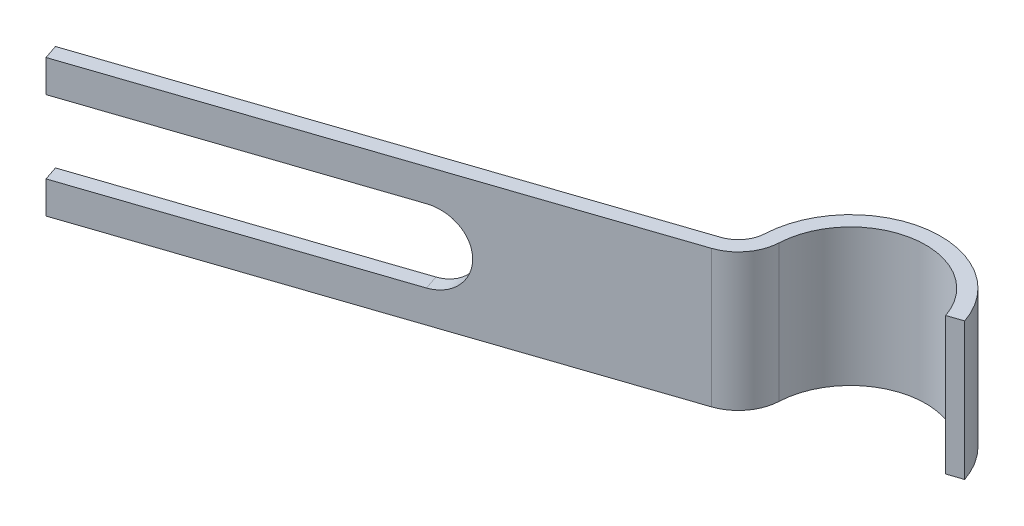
ISO-10303-21;
HEADER;
FILE_DESCRIPTION(('STEP AP214'),'2;1');
FILE_NAME('part.step','',(''),(''),'','','');
FILE_SCHEMA(('AUTOMOTIVE_DESIGN { 1 0 10303 214 1 1 1 1 }'));
ENDSEC;
DATA;
#1=APPLICATION_CONTEXT('core data for automotive mechanical design processes');
#2=APPLICATION_PROTOCOL_DEFINITION('international standard','automotive_design',2000,#1);
#3=PRODUCT_CONTEXT('',#1,'mechanical');
#4=PRODUCT('Part','Part','',(#3));
#5=PRODUCT_RELATED_PRODUCT_CATEGORY('part','',(#4));
#6=PRODUCT_DEFINITION_FORMATION('','',#4);
#7=PRODUCT_DEFINITION_CONTEXT('part definition',#1,'design');
#8=PRODUCT_DEFINITION('design','',#6,#7);
#9=PRODUCT_DEFINITION_SHAPE('','',#8);
#10=(LENGTH_UNIT() NAMED_UNIT(*) SI_UNIT(.MILLI.,.METRE.));
#11=(NAMED_UNIT(*) PLANE_ANGLE_UNIT() SI_UNIT($,.RADIAN.));
#12=(NAMED_UNIT(*) SI_UNIT($,.STERADIAN.) SOLID_ANGLE_UNIT());
#13=UNCERTAINTY_MEASURE_WITH_UNIT(LENGTH_MEASURE(1.E-05),#10,'distance_accuracy_value','');
#14=(GEOMETRIC_REPRESENTATION_CONTEXT(3) GLOBAL_UNCERTAINTY_ASSIGNED_CONTEXT((#13)) GLOBAL_UNIT_ASSIGNED_CONTEXT((#10,
#11,#12)) REPRESENTATION_CONTEXT('',''));
#15=CARTESIAN_POINT('',(0.,0.,0.));
#16=DIRECTION('',(0.,0.,1.));
#17=DIRECTION('',(1.,0.,0.));
#18=AXIS2_PLACEMENT_3D('',#15,#16,#17);
#19=CARTESIAN_POINT('',(16.8492572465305,2.75,-12.7269562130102));
#20=DIRECTION('',(-0.318689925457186,0.,-0.947859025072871));
#21=DIRECTION('',(-0.947859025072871,0.,0.318689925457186));
#22=AXIS2_PLACEMENT_3D('',#19,#20,#21);
#23=PLANE('',#22);
#24=DIRECTION('',(0.,1.,0.));
#25=VECTOR('',#24,1.);
#26=CARTESIAN_POINT('',(16.517506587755,2.75,-12.6154147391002));
#27=LINE('',#26,#25);
#28=CARTESIAN_POINT('',(16.517506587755,5.95,-12.6154147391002));
#29=VERTEX_POINT('',#28);
#30=CARTESIAN_POINT('',(16.517506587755,2.75,-12.6154147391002));
#31=VERTEX_POINT('',#30);
#32=EDGE_CURVE('E111',#29,#31,#27,.F.);
#33=ORIENTED_EDGE('',*,*,#32,.T.);
#34=DIRECTION('',(-0.947859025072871,0.,0.318689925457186));
#35=VECTOR('',#34,1.);
#36=CARTESIAN_POINT('',(16.8492572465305,2.75,-12.7269562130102));
#37=LINE('',#36,#35);
#38=CARTESIAN_POINT('',(16.8492572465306,2.75,-12.7269562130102));
#39=VERTEX_POINT('',#38);
#40=EDGE_CURVE('E148',#39,#31,#37,.T.);
#41=ORIENTED_EDGE('',*,*,#40,.F.);
#42=DIRECTION('',(0.,1.,0.));
#43=VECTOR('',#42,1.);
#44=CARTESIAN_POINT('',(16.8492572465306,2.75,-12.7269562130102));
#45=LINE('',#44,#43);
#46=CARTESIAN_POINT('',(16.8492572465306,5.95,-12.7269562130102));
#47=VERTEX_POINT('',#46);
#48=EDGE_CURVE('E112',#47,#39,#45,.F.);
#49=ORIENTED_EDGE('',*,*,#48,.F.);
#50=DIRECTION('',(-0.947859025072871,0.,0.318689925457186));
#51=VECTOR('',#50,1.);
#52=CARTESIAN_POINT('',(16.8492572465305,5.95,-12.7269562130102));
#53=LINE('',#52,#51);
#54=EDGE_CURVE('E104',#29,#47,#53,.F.);
#55=ORIENTED_EDGE('',*,*,#54,.F.);
#56=EDGE_LOOP('',(#33,#41,#49,#55));
#57=FACE_BOUND('',#56,.T.);
#58=ADVANCED_FACE('F17',(#57),#23,.F.);
#59=CARTESIAN_POINT('',(12.1118971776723,2.75,-12.1891664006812));
#60=DIRECTION('',(0.,1.,0.));
#61=DIRECTION('',(0.,0.,1.));
#62=AXIS2_PLACEMENT_3D('',#59,#60,#61);
#63=CYLINDRICAL_SURFACE('',#62,0.65);
#64=DIRECTION('',(0.,1.,0.));
#65=VECTOR('',#64,1.);
#66=CARTESIAN_POINT('',(12.7611540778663,2.75,-12.1580942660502));
#67=LINE('',#66,#65);
#68=CARTESIAN_POINT('',(12.7611540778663,2.75,-12.1580942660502));
#69=VERTEX_POINT('',#68);
#70=CARTESIAN_POINT('',(12.7611540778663,5.95,-12.1580942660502));
#71=VERTEX_POINT('',#70);
#72=EDGE_CURVE('E106',#69,#71,#67,.T.);
#73=ORIENTED_EDGE('',*,*,#72,.F.);
#74=CARTESIAN_POINT('',(12.1118971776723,2.75,-12.1891664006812));
#75=DIRECTION('',(0.,1.,0.));
#76=DIRECTION('',(0.,0.,1.));
#77=AXIS2_PLACEMENT_3D('',#74,#75,#76);
#78=CIRCLE('',#77,0.65);
#79=CARTESIAN_POINT('',(12.3190456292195,2.75,-11.5730580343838));
#80=VERTEX_POINT('',#79);
#81=EDGE_CURVE('E20',#80,#69,#78,.T.);
#82=ORIENTED_EDGE('',*,*,#81,.F.);
#83=DIRECTION('',(0.,1.,0.));
#84=VECTOR('',#83,1.);
#85=CARTESIAN_POINT('',(12.3190456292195,2.75,-11.5730580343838));
#86=LINE('',#85,#84);
#87=CARTESIAN_POINT('',(12.3190456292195,5.95,-11.5730580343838));
#88=VERTEX_POINT('',#87);
#89=EDGE_CURVE('E139',#88,#80,#86,.F.);
#90=ORIENTED_EDGE('',*,*,#89,.F.);
#91=CARTESIAN_POINT('',(12.1118971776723,5.95,-12.1891664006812));
#92=DIRECTION('',(0.,1.,0.));
#93=DIRECTION('',(0.,0.,1.));
#94=AXIS2_PLACEMENT_3D('',#91,#92,#93);
#95=CIRCLE('',#94,0.65);
#96=EDGE_CURVE('E103',#71,#88,#95,.F.);
#97=ORIENTED_EDGE('',*,*,#96,.F.);
#98=EDGE_LOOP('',(#73,#82,#90,#97));
#99=FACE_BOUND('',#98,.T.);
#100=ADVANCED_FACE('F107',(#99),#63,.F.);
#101=CARTESIAN_POINT('',(14.8587532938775,2.75,-12.0577073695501));
#102=DIRECTION('',(0.,1.,0.));
#103=DIRECTION('',(0.,0.,1.));
#104=AXIS2_PLACEMENT_3D('',#101,#102,#103);
#105=CYLINDRICAL_SURFACE('',#104,2.1);
#106=CARTESIAN_POINT('',(14.8587532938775,2.75,-12.0577073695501));
#107=DIRECTION('',(0.,1.,0.));
#108=DIRECTION('',(0.,0.,1.));
#109=AXIS2_PLACEMENT_3D('',#106,#107,#108);
#110=CIRCLE('',#109,2.1);
#111=EDGE_CURVE('E99',#69,#39,#110,.F.);
#112=ORIENTED_EDGE('',*,*,#111,.F.);
#113=ORIENTED_EDGE('',*,*,#72,.T.);
#114=CARTESIAN_POINT('',(14.8587532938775,5.95,-12.0577073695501));
#115=DIRECTION('',(0.,1.,0.));
#116=DIRECTION('',(0.,0.,1.));
#117=AXIS2_PLACEMENT_3D('',#114,#115,#116);
#118=CIRCLE('',#117,2.1);
#119=EDGE_CURVE('E131',#71,#47,#118,.F.);
#120=ORIENTED_EDGE('',*,*,#119,.T.);
#121=ORIENTED_EDGE('',*,*,#48,.T.);
#122=EDGE_LOOP('',(#112,#113,#120,#121));
#123=FACE_BOUND('',#122,.T.);
#124=ADVANCED_FACE('F115',(#123),#105,.T.);
#125=CARTESIAN_POINT('',(14.8587532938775,2.75,-12.0577073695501));
#126=DIRECTION('',(0.,1.,0.));
#127=DIRECTION('',(0.,0.,1.));
#128=AXIS2_PLACEMENT_3D('',#125,#126,#127);
#129=CYLINDRICAL_SURFACE('',#128,1.75);
#130=DIRECTION('',(0.,1.,0.));
#131=VECTOR('',#130,1.);
#132=CARTESIAN_POINT('',(13.1107539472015,2.75,-12.1413631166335));
#133=LINE('',#132,#131);
#134=CARTESIAN_POINT('',(13.1107539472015,2.75,-12.1413631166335));
#135=VERTEX_POINT('',#134);
#136=CARTESIAN_POINT('',(13.1107539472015,5.95,-12.1413631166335));
#137=VERTEX_POINT('',#136);
#138=EDGE_CURVE('E121',#135,#137,#133,.T.);
#139=ORIENTED_EDGE('',*,*,#138,.F.);
#140=CARTESIAN_POINT('',(14.8587532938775,2.75,-12.0577073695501));
#141=DIRECTION('',(0.,1.,0.));
#142=DIRECTION('',(0.,0.,1.));
#143=AXIS2_PLACEMENT_3D('',#140,#141,#142);
#144=CIRCLE('',#143,1.75);
#145=EDGE_CURVE('E117',#31,#135,#144,.T.);
#146=ORIENTED_EDGE('',*,*,#145,.F.);
#147=ORIENTED_EDGE('',*,*,#32,.F.);
#148=CARTESIAN_POINT('',(14.8587532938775,5.95,-12.0577073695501));
#149=DIRECTION('',(0.,1.,0.));
#150=DIRECTION('',(0.,0.,1.));
#151=AXIS2_PLACEMENT_3D('',#148,#149,#150);
#152=CIRCLE('',#151,1.75);
#153=EDGE_CURVE('E128',#29,#137,#152,.T.);
#154=ORIENTED_EDGE('',*,*,#153,.T.);
#155=EDGE_LOOP('',(#139,#146,#147,#154));
#156=FACE_BOUND('',#155,.T.);
#157=ADVANCED_FACE('F341',(#156),#129,.F.);
#158=CARTESIAN_POINT('',(1.19151482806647,2.75,-7.8317506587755));
#159=DIRECTION('',(-0.318689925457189,0.,-0.94785902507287));
#160=DIRECTION('',(-0.94785902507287,0.,0.318689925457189));
#161=AXIS2_PLACEMENT_3D('',#158,#159,#160);
#162=PLANE('',#161);
#163=DIRECTION('',(0.94785902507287,0.,-0.318689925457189));
#164=VECTOR('',#163,1.);
#165=CARTESIAN_POINT('',(0.717585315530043,2.75,-7.67240569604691));
#166=LINE('',#165,#164);
#167=CARTESIAN_POINT('',(0.717585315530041,2.75,-7.67240569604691));
#168=VERTEX_POINT('',#167);
#169=EDGE_CURVE('E102',#168,#80,#166,.T.);
#170=ORIENTED_EDGE('',*,*,#169,.F.);
#171=DIRECTION('',(0.,1.,0.));
#172=VECTOR('',#171,1.);
#173=CARTESIAN_POINT('',(0.71758531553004,2.75,-7.67240569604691));
#174=LINE('',#173,#172);
#175=CARTESIAN_POINT('',(0.717585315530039,3.5,-7.67240569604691));
#176=VERTEX_POINT('',#175);
#177=EDGE_CURVE('E156',#168,#176,#174,.T.);
#178=ORIENTED_EDGE('',*,*,#177,.T.);
#179=DIRECTION('',(0.94785902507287,0.,-0.318689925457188));
#180=VECTOR('',#179,1.);
#181=CARTESIAN_POINT('',(0.717585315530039,3.5,-7.67240569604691));
#182=LINE('',#181,#180);
#183=CARTESIAN_POINT('',(7.35259849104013,3.5,-9.90323517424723));
#184=VERTEX_POINT('',#183);
#185=EDGE_CURVE('E205',#176,#184,#182,.T.);
#186=ORIENTED_EDGE('',*,*,#185,.T.);
#187=CARTESIAN_POINT('',(7.35259849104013,4.35,-9.90323517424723));
#188=DIRECTION('',(-0.318689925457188,0.,-0.94785902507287));
#189=DIRECTION('',(-0.94785902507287,0.,0.318689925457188));
#190=AXIS2_PLACEMENT_3D('',#187,#188,#189);
#191=CIRCLE('',#190,0.85);
#192=CARTESIAN_POINT('',(7.35259849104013,5.2,-9.90323517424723));
#193=VERTEX_POINT('',#192);
#194=EDGE_CURVE('E150',#184,#193,#191,.F.);
#195=ORIENTED_EDGE('',*,*,#194,.T.);
#196=DIRECTION('',(-0.94785902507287,0.,0.318689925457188));
#197=VECTOR('',#196,1.);
#198=CARTESIAN_POINT('',(7.35259849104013,5.2,-9.90323517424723));
#199=LINE('',#198,#197);
#200=CARTESIAN_POINT('',(0.71758531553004,5.2,-7.67240569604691));
#201=VERTEX_POINT('',#200);
#202=EDGE_CURVE('E141',#193,#201,#199,.T.);
#203=ORIENTED_EDGE('',*,*,#202,.T.);
#204=DIRECTION('',(0.,1.,0.));
#205=VECTOR('',#204,1.);
#206=CARTESIAN_POINT('',(0.71758531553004,2.75,-7.67240569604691));
#207=LINE('',#206,#205);
#208=CARTESIAN_POINT('',(0.717585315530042,5.95,-7.67240569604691));
#209=VERTEX_POINT('',#208);
#210=EDGE_CURVE('E132',#201,#209,#207,.T.);
#211=ORIENTED_EDGE('',*,*,#210,.T.);
#212=DIRECTION('',(0.94785902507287,0.,-0.318689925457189));
#213=VECTOR('',#212,1.);
#214=CARTESIAN_POINT('',(0.717585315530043,5.95,-7.67240569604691));
#215=LINE('',#214,#213);
#216=EDGE_CURVE('E127',#209,#88,#215,.T.);
#217=ORIENTED_EDGE('',*,*,#216,.T.);
#218=ORIENTED_EDGE('',*,*,#89,.T.);
#219=EDGE_LOOP('',(#170,#178,#186,#195,#203,#211,#217,#218));
#220=FACE_BOUND('',#219,.T.);
#221=ADVANCED_FACE('F237',(#220),#162,.T.);
#222=CARTESIAN_POINT('',(3.38883387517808,5.2,0.272517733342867));
#223=DIRECTION('',(0.,1.,0.));
#224=DIRECTION('',(0.,0.,1.));
#225=AXIS2_PLACEMENT_3D('',#222,#223,#224);
#226=PLANE('',#225);
#227=DIRECTION('',(-0.318689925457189,0.,-0.94785902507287));
#228=VECTOR('',#227,1.);
#229=CARTESIAN_POINT('',(0.829126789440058,5.2,-7.3406550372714));
#230=LINE('',#229,#228);
#231=CARTESIAN_POINT('',(0.829126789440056,5.2,-7.34065503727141));
#232=VERTEX_POINT('',#231);
#233=EDGE_CURVE('E144',#232,#201,#230,.T.);
#234=ORIENTED_EDGE('',*,*,#233,.T.);
#235=ORIENTED_EDGE('',*,*,#202,.F.);
#236=DIRECTION('',(-0.318689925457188,0.,-0.94785902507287));
#237=VECTOR('',#236,1.);
#238=CARTESIAN_POINT('',(10.0238470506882,5.2,-1.95831174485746));
#239=LINE('',#238,#237);
#240=CARTESIAN_POINT('',(7.46413996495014,5.2,-9.57148451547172));
#241=VERTEX_POINT('',#240);
#242=EDGE_CURVE('E152',#193,#241,#239,.F.);
#243=ORIENTED_EDGE('',*,*,#242,.T.);
#244=DIRECTION('',(-0.94785902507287,0.,0.318689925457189));
#245=VECTOR('',#244,1.);
#246=CARTESIAN_POINT('',(1.30305630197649,5.2,-7.5));
#247=LINE('',#246,#245);
#248=EDGE_CURVE('E194',#241,#232,#247,.T.);
#249=ORIENTED_EDGE('',*,*,#248,.T.);
#250=EDGE_LOOP('',(#234,#235,#243,#249));
#251=FACE_BOUND('',#250,.T.);
#252=ADVANCED_FACE('F233',(#251),#226,.F.);
#253=CARTESIAN_POINT('',(0.829126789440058,2.75,-7.3406550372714));
#254=DIRECTION('',(0.94785902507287,0.,-0.318689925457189));
#255=DIRECTION('',(-0.318689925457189,0.,-0.94785902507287));
#256=AXIS2_PLACEMENT_3D('',#253,#254,#255);
#257=PLANE('',#256);
#258=ORIENTED_EDGE('',*,*,#233,.F.);
#259=DIRECTION('',(0.,1.,0.));
#260=VECTOR('',#259,1.);
#261=CARTESIAN_POINT('',(0.829126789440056,2.75,-7.34065503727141));
#262=LINE('',#261,#260);
#263=CARTESIAN_POINT('',(0.829126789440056,5.95,-7.34065503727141));
#264=VERTEX_POINT('',#263);
#265=EDGE_CURVE('E181',#232,#264,#262,.T.);
#266=ORIENTED_EDGE('',*,*,#265,.T.);
#267=DIRECTION('',(-0.318689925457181,0.,-0.947859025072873));
#268=VECTOR('',#267,1.);
#269=CARTESIAN_POINT('',(0.829126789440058,5.95,-7.3406550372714));
#270=LINE('',#269,#268);
#271=EDGE_CURVE('E130',#264,#209,#270,.T.);
#272=ORIENTED_EDGE('',*,*,#271,.T.);
#273=ORIENTED_EDGE('',*,*,#210,.F.);
#274=EDGE_LOOP('',(#258,#266,#272,#273));
#275=FACE_BOUND('',#274,.T.);
#276=ADVANCED_FACE('F230',(#275),#257,.F.);
#277=CARTESIAN_POINT('',(12.1118971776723,5.95,-12.1891664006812));
#278=DIRECTION('',(0.,-1.,0.));
#279=DIRECTION('',(0.,0.,-1.));
#280=AXIS2_PLACEMENT_3D('',#277,#278,#279);
#281=PLANE('',#280);
#282=ORIENTED_EDGE('',*,*,#271,.F.);
#283=DIRECTION('',(-0.94785902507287,0.,0.318689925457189));
#284=VECTOR('',#283,1.);
#285=CARTESIAN_POINT('',(1.30305630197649,5.95,-7.5));
#286=LINE('',#285,#284);
#287=CARTESIAN_POINT('',(12.4305871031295,5.95,-11.2413073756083));
#288=VERTEX_POINT('',#287);
#289=EDGE_CURVE('E178',#264,#288,#286,.F.);
#290=ORIENTED_EDGE('',*,*,#289,.T.);
#291=CARTESIAN_POINT('',(12.1118971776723,5.95,-12.1891664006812));
#292=DIRECTION('',(0.,1.,0.));
#293=DIRECTION('',(0.,0.,1.));
#294=AXIS2_PLACEMENT_3D('',#291,#292,#293);
#295=CIRCLE('',#294,1.);
#296=EDGE_CURVE('E125',#137,#288,#295,.F.);
#297=ORIENTED_EDGE('',*,*,#296,.F.);
#298=ORIENTED_EDGE('',*,*,#153,.F.);
#299=ORIENTED_EDGE('',*,*,#54,.T.);
#300=ORIENTED_EDGE('',*,*,#119,.F.);
#301=ORIENTED_EDGE('',*,*,#96,.T.);
#302=ORIENTED_EDGE('',*,*,#216,.F.);
#303=EDGE_LOOP('',(#282,#290,#297,#298,#299,#300,#301,#302));
#304=FACE_BOUND('',#303,.T.);
#305=ADVANCED_FACE('F220',(#304),#281,.F.);
#306=CARTESIAN_POINT('',(12.1118971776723,2.75,-12.1891664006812));
#307=DIRECTION('',(0.,1.,0.));
#308=DIRECTION('',(0.,0.,1.));
#309=AXIS2_PLACEMENT_3D('',#306,#307,#308);
#310=CYLINDRICAL_SURFACE('',#309,1.);
#311=CARTESIAN_POINT('',(12.1118971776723,2.75,-12.1891664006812));
#312=DIRECTION('',(0.,1.,0.));
#313=DIRECTION('',(0.,0.,1.));
#314=AXIS2_PLACEMENT_3D('',#311,#312,#313);
#315=CIRCLE('',#314,1.);
#316=CARTESIAN_POINT('',(12.4305871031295,2.75,-11.2413073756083));
#317=VERTEX_POINT('',#316);
#318=EDGE_CURVE('E119',#135,#317,#315,.F.);
#319=ORIENTED_EDGE('',*,*,#318,.F.);
#320=ORIENTED_EDGE('',*,*,#138,.T.);
#321=ORIENTED_EDGE('',*,*,#296,.T.);
#322=DIRECTION('',(0.,1.,0.));
#323=VECTOR('',#322,1.);
#324=CARTESIAN_POINT('',(12.4305871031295,2.75,-11.2413073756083));
#325=LINE('',#324,#323);
#326=EDGE_CURVE('E171',#288,#317,#325,.F.);
#327=ORIENTED_EDGE('',*,*,#326,.T.);
#328=EDGE_LOOP('',(#319,#320,#321,#327));
#329=FACE_BOUND('',#328,.T.);
#330=ADVANCED_FACE('F214',(#329),#310,.T.);
#331=CARTESIAN_POINT('',(12.1118971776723,2.75,-12.1891664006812));
#332=DIRECTION('',(0.,-1.,0.));
#333=DIRECTION('',(0.,0.,-1.));
#334=AXIS2_PLACEMENT_3D('',#331,#332,#333);
#335=PLANE('',#334);
#336=DIRECTION('',(-0.94785902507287,0.,0.318689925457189));
#337=VECTOR('',#336,1.);
#338=CARTESIAN_POINT('',(1.30305630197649,2.75,-7.5));
#339=LINE('',#338,#337);
#340=CARTESIAN_POINT('',(0.829126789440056,2.75,-7.34065503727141));
#341=VERTEX_POINT('',#340);
#342=EDGE_CURVE('E168',#317,#341,#339,.T.);
#343=ORIENTED_EDGE('',*,*,#342,.T.);
#344=DIRECTION('',(-0.318689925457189,0.,-0.94785902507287));
#345=VECTOR('',#344,1.);
#346=CARTESIAN_POINT('',(0.829126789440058,2.75,-7.3406550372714));
#347=LINE('',#346,#345);
#348=EDGE_CURVE('E153',#341,#168,#347,.T.);
#349=ORIENTED_EDGE('',*,*,#348,.T.);
#350=ORIENTED_EDGE('',*,*,#169,.T.);
#351=ORIENTED_EDGE('',*,*,#81,.T.);
#352=ORIENTED_EDGE('',*,*,#111,.T.);
#353=ORIENTED_EDGE('',*,*,#40,.T.);
#354=ORIENTED_EDGE('',*,*,#145,.T.);
#355=ORIENTED_EDGE('',*,*,#318,.T.);
#356=EDGE_LOOP('',(#343,#349,#350,#351,#352,#353,#354,#355));
#357=FACE_BOUND('',#356,.T.);
#358=ADVANCED_FACE('F97',(#357),#335,.T.);
#359=CARTESIAN_POINT('',(0.829126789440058,2.75,-7.3406550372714));
#360=DIRECTION('',(0.94785902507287,0.,-0.318689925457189));
#361=DIRECTION('',(-0.318689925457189,0.,-0.94785902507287));
#362=AXIS2_PLACEMENT_3D('',#359,#360,#361);
#363=PLANE('',#362);
#364=DIRECTION('',(-0.318689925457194,0.,-0.947859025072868));
#365=VECTOR('',#364,1.);
#366=CARTESIAN_POINT('',(0.829126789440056,3.5,-7.34065503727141));
#367=LINE('',#366,#365);
#368=CARTESIAN_POINT('',(0.829126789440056,3.5,-7.34065503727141));
#369=VERTEX_POINT('',#368);
#370=EDGE_CURVE('E160',#369,#176,#367,.T.);
#371=ORIENTED_EDGE('',*,*,#370,.T.);
#372=ORIENTED_EDGE('',*,*,#177,.F.);
#373=ORIENTED_EDGE('',*,*,#348,.F.);
#374=DIRECTION('',(0.,1.,0.));
#375=VECTOR('',#374,1.);
#376=CARTESIAN_POINT('',(0.829126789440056,2.75,-7.34065503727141));
#377=LINE('',#376,#375);
#378=EDGE_CURVE('E170',#341,#369,#377,.T.);
#379=ORIENTED_EDGE('',*,*,#378,.T.);
#380=EDGE_LOOP('',(#371,#372,#373,#379));
#381=FACE_BOUND('',#380,.T.);
#382=ADVANCED_FACE('F263',(#381),#363,.F.);
#383=CARTESIAN_POINT('',(3.38883387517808,3.5,0.272517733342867));
#384=DIRECTION('',(0.,-1.,0.));
#385=DIRECTION('',(1.,0.,0.));
#386=AXIS2_PLACEMENT_3D('',#383,#384,#385);
#387=PLANE('',#386);
#388=DIRECTION('',(-0.318689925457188,0.,-0.94785902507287));
#389=VECTOR('',#388,1.);
#390=CARTESIAN_POINT('',(10.0238470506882,3.5,-1.95831174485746));
#391=LINE('',#390,#389);
#392=CARTESIAN_POINT('',(7.46413996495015,3.5,-9.57148451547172));
#393=VERTEX_POINT('',#392);
#394=EDGE_CURVE('E34',#393,#184,#391,.T.);
#395=ORIENTED_EDGE('',*,*,#394,.T.);
#396=ORIENTED_EDGE('',*,*,#185,.F.);
#397=ORIENTED_EDGE('',*,*,#370,.F.);
#398=DIRECTION('',(-0.94785902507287,0.,0.318689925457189));
#399=VECTOR('',#398,1.);
#400=CARTESIAN_POINT('',(1.30305630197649,3.5,-7.5));
#401=LINE('',#400,#399);
#402=EDGE_CURVE('E26',#369,#393,#401,.F.);
#403=ORIENTED_EDGE('',*,*,#402,.T.);
#404=EDGE_LOOP('',(#395,#396,#397,#403));
#405=FACE_BOUND('',#404,.T.);
#406=ADVANCED_FACE('F242',(#405),#387,.F.);
#407=CARTESIAN_POINT('',(10.0238470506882,4.35,-1.95831174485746));
#408=DIRECTION('',(-0.318689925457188,0.,-0.94785902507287));
#409=DIRECTION('',(-0.94785902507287,0.,0.318689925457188));
#410=AXIS2_PLACEMENT_3D('',#407,#408,#409);
#411=CYLINDRICAL_SURFACE('',#410,0.85);
#412=ORIENTED_EDGE('',*,*,#242,.F.);
#413=ORIENTED_EDGE('',*,*,#194,.F.);
#414=ORIENTED_EDGE('',*,*,#394,.F.);
#415=CARTESIAN_POINT('',(7.46413996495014,4.35,-9.57148451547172));
#416=DIRECTION('',(-0.318689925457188,0.,-0.94785902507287));
#417=DIRECTION('',(-0.94785902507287,0.,0.318689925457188));
#418=AXIS2_PLACEMENT_3D('',#415,#416,#417);
#419=CIRCLE('',#418,0.85);
#420=EDGE_CURVE('E11',#393,#241,#419,.F.);
#421=ORIENTED_EDGE('',*,*,#420,.T.);
#422=EDGE_LOOP('',(#412,#413,#414,#421));
#423=FACE_BOUND('',#422,.T.);
#424=ADVANCED_FACE('F239',(#423),#411,.F.);
#425=CARTESIAN_POINT('',(1.30305630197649,2.75,-7.5));
#426=DIRECTION('',(-0.318689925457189,0.,-0.94785902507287));
#427=DIRECTION('',(-0.94785902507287,0.,0.318689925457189));
#428=AXIS2_PLACEMENT_3D('',#425,#426,#427);
#429=PLANE('',#428);
#430=ORIENTED_EDGE('',*,*,#402,.F.);
#431=ORIENTED_EDGE('',*,*,#378,.F.);
#432=ORIENTED_EDGE('',*,*,#342,.F.);
#433=ORIENTED_EDGE('',*,*,#326,.F.);
#434=ORIENTED_EDGE('',*,*,#289,.F.);
#435=ORIENTED_EDGE('',*,*,#265,.F.);
#436=ORIENTED_EDGE('',*,*,#248,.F.);
#437=ORIENTED_EDGE('',*,*,#420,.F.);
#438=EDGE_LOOP('',(#430,#431,#432,#433,#434,#435,#436,#437));
#439=FACE_BOUND('',#438,.T.);
#440=ADVANCED_FACE('F225',(#439),#429,.F.);
#441=CLOSED_SHELL('',(#58,#100,#124,#157,#221,#252,#276,#305,#330,#358,#382,#406,#424,#440));
#442=MANIFOLD_SOLID_BREP('B1',#441);
#443=ADVANCED_BREP_SHAPE_REPRESENTATION('',(#18,#442),#14);
#444=SHAPE_DEFINITION_REPRESENTATION(#9,#443);
ENDSEC;
END-ISO-10303-21;
